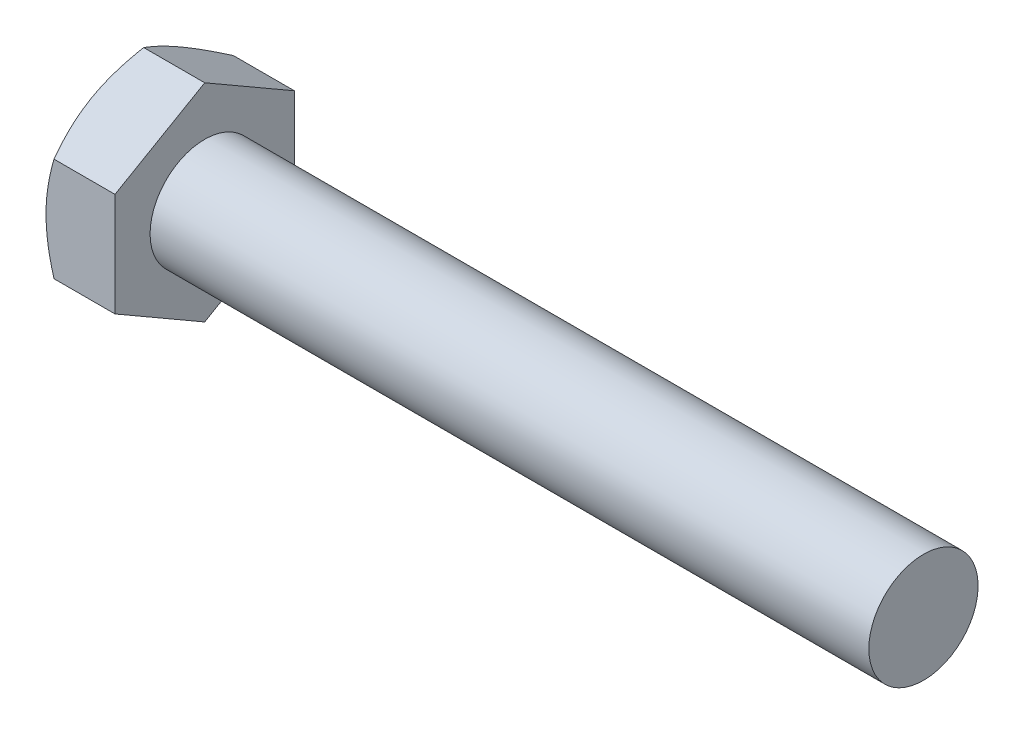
from build123d import *

# Parameters (mm, degrees)
SKETCH2_R     = 4.621274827
HEX_DIE_DEPTH = 3.048
SKETCH4_R     = 3.4671
INDENT_DEPTH  = 0.381


with BuildPart() as part:
    # BodySke → Base-Revolve (revolve)
    with BuildSketch(Plane.XY, mode=Mode.PRIVATE) as base_revolve_sk:
        Polygon((3.048, 2.413), (3.048, 4.57551963), (0.353984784, 4.57551963), (0, 3.9624), (0, 0), (34.798, 0), (34.798, 2.413), align=None)
    revolve(base_revolve_sk.sketch.rotate(Axis((-25.4, 0, 0), (1, 0, 0)), 90), axis=Axis((-25.4, 0, 0), (1, 0, 0)))

    # Sketch2 → Hex-Die (cut)
    with BuildSketch(Plane(origin=(0, 0, 0), x_dir=(0, 0, -1), z_dir=(1, 0, 0))):
        Circle(SKETCH2_R)
        Polygon((-3.9624, 2.287692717), (0, 4.575385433), (3.9624, 2.287692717), (3.9624, -2.287692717), (0, -4.575385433), (-3.9624, -2.287692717), align=None, mode=Mode.SUBTRACT)
    extrude(amount=HEX_DIE_DEPTH, mode=Mode.SUBTRACT)

    # Sketch4 → Indent (cut)
    with BuildSketch(Plane(origin=(0, 0, 0), x_dir=(0, 0, -1), z_dir=(1, 0, 0))):
        with Locations(Location((0, 0, 0), (0, 0, 180))):
            Circle(SKETCH4_R)
    extrude(amount=INDENT_DEPTH, mode=Mode.SUBTRACT)


solid = part.part
